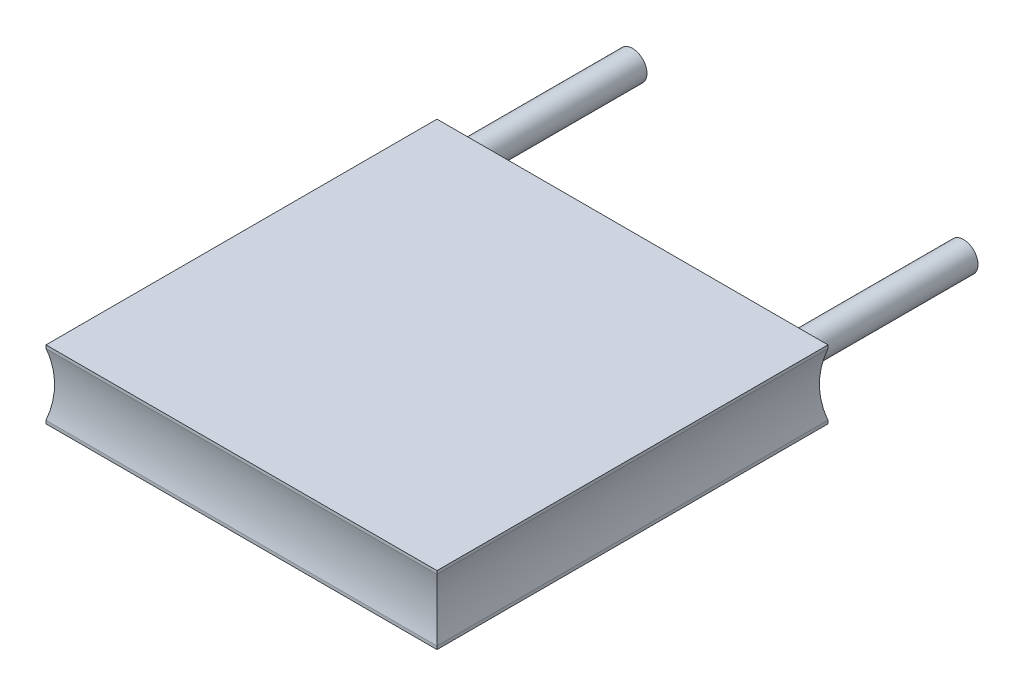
from build123d import *

# Parameters (mm, degrees)
SKETCH1_W             = 30
SKETCH1_H             = 30
BOSS_EXTRUDE1_DEPTH   = 2.625
CUT_EXTRUDE1_DEPTH    = 34.643582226
CUT_EXTRUDE2_DEPTH    = 34.643582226
SKETCH4_R             = 1.11125
BOSS_EXTRUDE2_DEPTH   = 12.7
BOSS_EXTRUDE2_2_DEPTH = 12.7


with BuildPart() as part:
    # Sketch1 → Boss-Extrude1 (new, symmetric)
    with BuildSketch(Plane(origin=(0, 0, 0), x_dir=(1, 0, 0), z_dir=(0, 1, 0))):
        Rectangle(SKETCH1_W, SKETCH1_H)
    extrude(amount=BOSS_EXTRUDE1_DEPTH, both=True)

    # Sketch2 → Cut-Extrude1 (cut, through all)
    with BuildSketch(Plane.XY.offset(15)):
        with BuildLine():
            ThreePointArc((-14.6698, 0), (-14.752743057, 1.202017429), (-15, 2.38125))
            Line((-15, 2.38125), (-15, 0))
            Line((-15, 0), (-14.6698, 0))
        make_face()
        with BuildLine():
            Line((-14.6698, 0), (-15, 0))
            Line((-15, 0), (-15, -2.38125))
            ThreePointArc((-15, -2.38125), (-14.752743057, -1.202017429), (-14.6698, 0))
        make_face()
        with BuildLine():
            ThreePointArc((-14.6698, 0), (-14.752743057, 1.202017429), (-15, 2.38125))
            Line((-15, 2.38125), (-15, 0))
            Line((-15, 0), (-14.6698, 0))
        make_face()
        with BuildLine():
            Line((-14.6698, 0), (-15, 0))
            Line((-15, 0), (-15, -2.38125))
            ThreePointArc((-15, -2.38125), (-14.752743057, -1.202017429), (-14.6698, 0))
        make_face()
        with BuildLine():
            Line((15, -2.38125), (15, 2.38125))
            ThreePointArc((15, 2.38125), (14.6698, 0), (15, -2.38125))
        make_face()
    extrude(amount=-CUT_EXTRUDE1_DEPTH, mode=Mode.SUBTRACT)

    # Sketch3 → Cut-Extrude2 (cut, through all)
    with BuildSketch(Plane.ZY.offset(15)):
        with BuildLine():
            Line((-15, 2.38125), (-15, -2.38125))
            ThreePointArc((-15, -2.38125), (-14.6698, 0), (-15, 2.38125))
        make_face()
        with BuildLine():
            Line((15, 2.38125), (15, -2.38125))
            ThreePointArc((15, -2.38125), (14.6698, 0), (15, 2.38125))
        make_face()
    extrude(amount=-CUT_EXTRUDE2_DEPTH, mode=Mode.SUBTRACT)


with BuildPart() as body_2:
    # Sketch4 → Boss-Extrude2 (new body)
    with BuildSketch(Plane(origin=(0, 0, -15), x_dir=(-1, 0, 0), z_dir=(0, 0, -1))):
        with Locations((-12.7, 1.016)):
            Circle(SKETCH4_R)
    extrude(amount=BOSS_EXTRUDE2_DEPTH)


with BuildPart() as body_3:
    # Sketch4 → Boss-Extrude2 2 (new body)
    with BuildSketch(Plane(origin=(0, 0, -15), x_dir=(-1, 0, 0), z_dir=(0, 0, -1))):
        with Locations((12.7, 1.016)):
            Circle(SKETCH4_R)
    extrude(amount=BOSS_EXTRUDE2_2_DEPTH)


solid = Compound([part.part, body_2.part, body_3.part])
